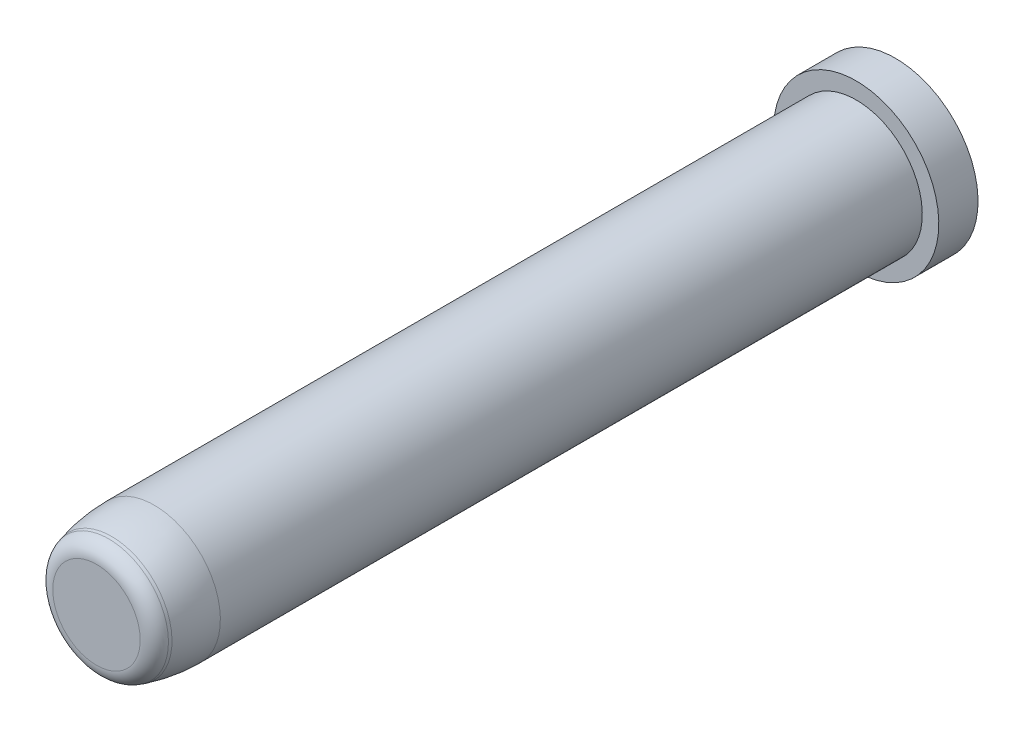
from build123d import *


with BuildPart() as part:
    # Sketch1 → Revolve1 (revolve)
    with BuildSketch(Plane(origin=(0, 0, -33), x_dir=(0, 0, 1), z_dir=(-1, 0, 0)), mode=Mode.PRIVATE) as revolve1_sk:
        with BuildLine():
            Line((125, 0), (125, 5.295225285))
            ThreePointArc((125, 5.295225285), (124.58670668, 6.512748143), (123.51763809, 7.227076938))
            Line((123.51763809, 7.227076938), (123.176380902, 7.318516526))
            ThreePointArc((123.176380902, 7.318516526), (120.610523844, 7.828897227), (118, 8))
            Line((118, 8), (33, 8))
            Line((33, 8), (33, 10))
            Line((33, 10), (28.249196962, 10))
            Line((28.249196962, 10), (25, 0))
            Line((25, 0), (125, 0))
        make_face()
    revolve(revolve1_sk.sketch.rotate(Axis((0, 0, -8), (0, 0, -1)), 180), axis=Axis((0, 0, -8), (0, 0, -1)))


solid = part.part
